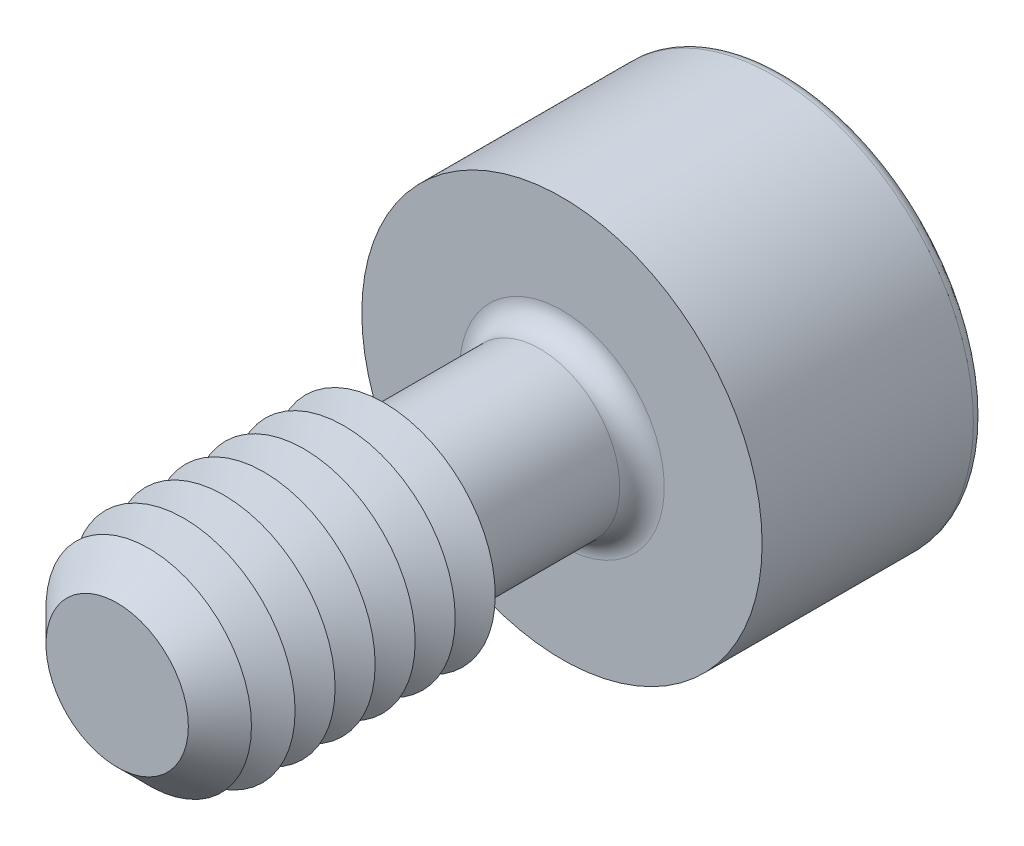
from build123d import *

# Parameters (mm, degrees)
SKETCH1_R       = 0.9
EXTRUDE1_DEPTH  = 2.5
CHAMFER1_SIZE   = 0.45
SKETCH3_R       = 2.25
EXTRUDE2_DEPTH  = 2.5
EXTRUDE3_DEPTH  = 2
FILLET1_R       = 0.25
FILLET2_R       = 0.125
LPATTERN1_COUNT = 6
LPATTERN1_PITCH = 0.45


with BuildPart() as part:
    # Sketch1 → Extrude1 (new, symmetric)
    with BuildSketch(Plane.XY):
        Circle(SKETCH1_R)
    extrude(amount=EXTRUDE1_DEPTH, both=True)

    # Sketch2 → Revolve1 (revolve)
    with BuildSketch(Plane(origin=(0, 0, 0), x_dir=(0, 0, -1), z_dir=(1, 0, 0))):
        Polygon((-2.5, 0), (-2.5, 1.25), (0.5, 1.25), (0.702072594, 0.9), (0.702072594, 0), align=None)
    revolve(axis=Axis((0, 0, -0.702072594), (0, 0, 1)))

    # Chamfer1
    chamfer1_edges = [part.edges().sort_by_distance(p)[0] for p in [
        (0, -1.25, 2.5),
    ]]
    chamfer(chamfer1_edges, length=CHAMFER1_SIZE)

    # Sketch3 → Extrude2 (add)
    with BuildSketch(Plane(origin=(0, 0, -2.5), x_dir=(-1, 0, 0), z_dir=(0, 0, -1))):
        Circle(SKETCH3_R)
    extrude(amount=EXTRUDE2_DEPTH)

    # Sketch4 → Extrude3 (cut)
    with BuildSketch(Plane(origin=(-13.7, 0, -5), x_dir=(1, 0, 0), z_dir=(0, 0, 1))):
        Polygon((13.122649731, -1), (14.277350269, -1), (14.854700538, 0), (14.277350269, 1), (13.122649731, 1), (12.545299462, 0), align=None)
    extrude(amount=EXTRUDE3_DEPTH, mode=Mode.SUBTRACT)

    # Fillet1
    fillet1_edges = [part.edges().sort_by_distance(p)[0] for p in [
        (-0.9, 0, -2.5),
    ]]
    fillet(fillet1_edges, radius=FILLET1_R)

    # Fillet2
    fillet2_edges = [part.edges().sort_by_distance(p)[0] for p in [
        (2.25, 0, -5),
    ]]
    fillet(fillet2_edges, radius=FILLET2_R)

    # Sketch5 → Cut-Revolve1 (revolve, cut)
    with BuildSketch(Plane(origin=(0, 0, 0), x_dir=(0, 0, -1), z_dir=(1, 0, 0)), mode=Mode.PRIVATE) as cut_revolve1_sk:
        Polygon((3, 0), (3, -1), (2.422649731, 0), align=None)
    revolve(cut_revolve1_sk.sketch.rotate(Axis((0, 0, -2.422649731), (0, 0, -1)), 90), axis=Axis((0, 0, -2.422649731), (0, 0, -1)), mode=Mode.SUBTRACT)

    # Sketch7 → Cut-Revolve2 (revolve, cut)
    with BuildSketch(Plane(origin=(0, 0, 0), x_dir=(0, 0, -1), z_dir=(1, 0, 0)), mode=Mode.PRIVATE) as cut_revolve2_sk:
        Polygon((0.5, 1.25), (0.275, 0.860288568), (0.05, 1.25), align=None)
    cut_revolve2 = revolve(cut_revolve2_sk.sketch.rotate(Axis((0, 0, -1.332048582), (0, 0, 1)), 90), axis=Axis((0, 0, -1.332048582), (0, 0, 1)), mode=Mode.SUBTRACT)

    # LPattern1: Cut-Revolve2 ×6
    with Locations(*[(0, 0, i * LPATTERN1_PITCH) for i in range(1, LPATTERN1_COUNT)]):
        add(cut_revolve2, mode=Mode.SUBTRACT)


solid = part.part
